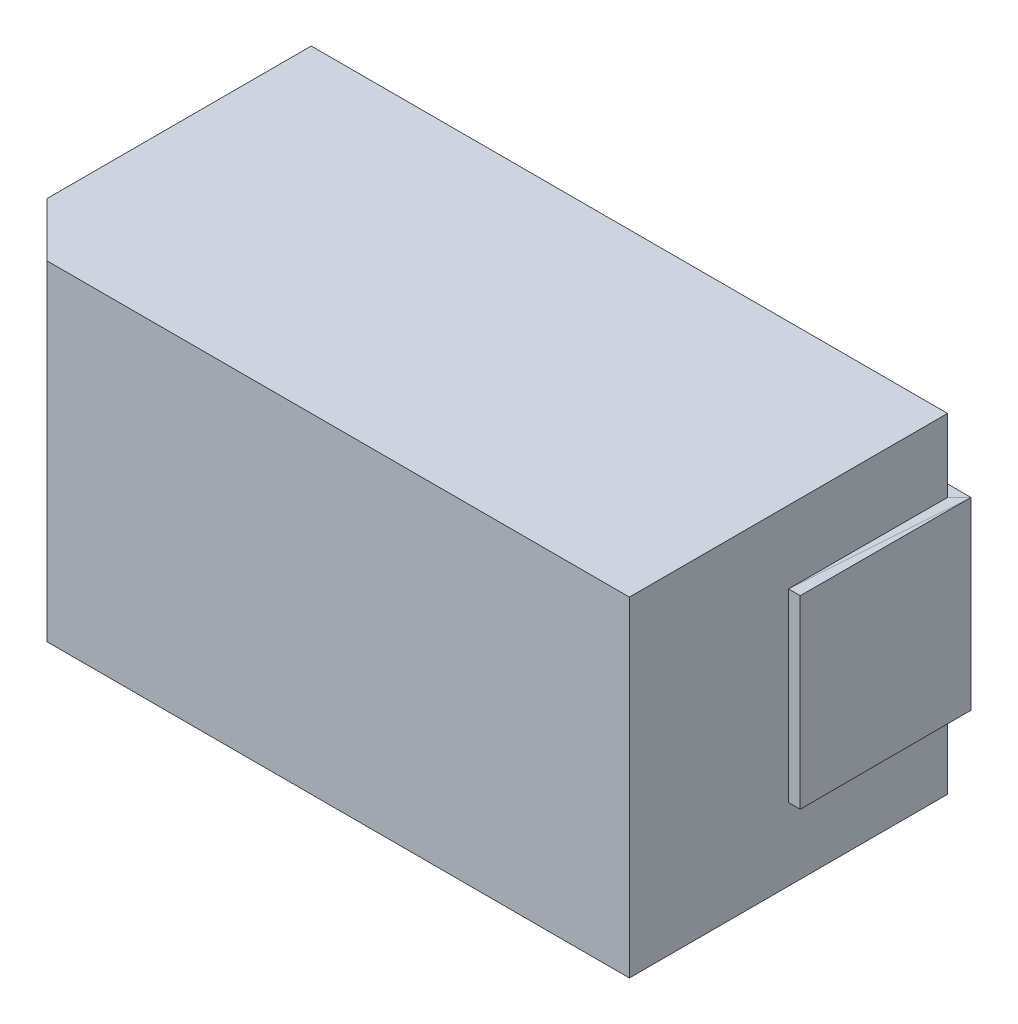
ISO-10303-21;
HEADER;
FILE_DESCRIPTION(('STEP AP214'),'2;1');
FILE_NAME('part.step','',(''),(''),'','','');
FILE_SCHEMA(('AUTOMOTIVE_DESIGN { 1 0 10303 214 1 1 1 1 }'));
ENDSEC;
DATA;
#1=APPLICATION_CONTEXT('core data for automotive mechanical design processes');
#2=APPLICATION_PROTOCOL_DEFINITION('international standard','automotive_design',2000,#1);
#3=PRODUCT_CONTEXT('',#1,'mechanical');
#4=PRODUCT('Part','Part','',(#3));
#5=PRODUCT_RELATED_PRODUCT_CATEGORY('part','',(#4));
#6=PRODUCT_DEFINITION_FORMATION('','',#4);
#7=PRODUCT_DEFINITION_CONTEXT('part definition',#1,'design');
#8=PRODUCT_DEFINITION('design','',#6,#7);
#9=PRODUCT_DEFINITION_SHAPE('','',#8);
#10=(LENGTH_UNIT() NAMED_UNIT(*) SI_UNIT(.MILLI.,.METRE.));
#11=(NAMED_UNIT(*) PLANE_ANGLE_UNIT() SI_UNIT($,.RADIAN.));
#12=(NAMED_UNIT(*) SI_UNIT($,.STERADIAN.) SOLID_ANGLE_UNIT());
#13=UNCERTAINTY_MEASURE_WITH_UNIT(LENGTH_MEASURE(1.E-05),#10,'distance_accuracy_value','');
#14=(GEOMETRIC_REPRESENTATION_CONTEXT(3) GLOBAL_UNCERTAINTY_ASSIGNED_CONTEXT((#13)) GLOBAL_UNIT_ASSIGNED_CONTEXT((#10,
#11,#12)) REPRESENTATION_CONTEXT('',''));
#15=CARTESIAN_POINT('',(0.,0.,0.));
#16=DIRECTION('',(0.,0.,1.));
#17=DIRECTION('',(1.,0.,0.));
#18=AXIS2_PLACEMENT_3D('',#15,#16,#17);
#19=CARTESIAN_POINT('',(-1.530000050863,-0.427379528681,0.0113731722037));
#20=DIRECTION('',(0.,0.,1.));
#21=DIRECTION('',(1.,0.,0.));
#22=AXIS2_PLACEMENT_3D('',#19,#20,#21);
#23=PLANE('',#22);
#24=DIRECTION('',(0.,1.,0.));
#25=VECTOR('',#24,1.);
#26=CARTESIAN_POINT('',(-0.491878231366,-0.427379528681,0.0113731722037));
#27=LINE('',#26,#25);
#28=CARTESIAN_POINT('',(-0.491878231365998,0.427380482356,0.0113731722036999));
#29=VERTEX_POINT('',#28);
#30=CARTESIAN_POINT('',(-0.491878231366,-0.427379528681,0.0113731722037));
#31=VERTEX_POINT('',#30);
#32=EDGE_CURVE('E163',#29,#31,#27,.F.);
#33=ORIENTED_EDGE('',*,*,#32,.T.);
#34=DIRECTION('',(1.,0.,0.));
#35=VECTOR('',#34,1.);
#36=CARTESIAN_POINT('',(-0.491878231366,-0.427379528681,0.0113731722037));
#37=LINE('',#36,#35);
#38=CARTESIAN_POINT('',(-1.530000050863,-0.42737952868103,0.0113731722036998));
#39=VERTEX_POINT('',#38);
#40=EDGE_CURVE('E142',#31,#39,#37,.F.);
#41=ORIENTED_EDGE('',*,*,#40,.T.);
#42=DIRECTION('',(0.,1.,0.));
#43=VECTOR('',#42,1.);
#44=CARTESIAN_POINT('',(-1.530000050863,-0.427379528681,0.0113731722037));
#45=LINE('',#44,#43);
#46=CARTESIAN_POINT('',(-1.530000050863,0.427380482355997,0.0113731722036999));
#47=VERTEX_POINT('',#46);
#48=EDGE_CURVE('E20',#47,#39,#45,.F.);
#49=ORIENTED_EDGE('',*,*,#48,.F.);
#50=DIRECTION('',(1.,0.,0.));
#51=VECTOR('',#50,1.);
#52=CARTESIAN_POINT('',(-1.475634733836,0.427380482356,0.0113731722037));
#53=LINE('',#52,#51);
#54=EDGE_CURVE('E139',#47,#29,#53,.T.);
#55=ORIENTED_EDGE('',*,*,#54,.T.);
#56=EDGE_LOOP('',(#33,#41,#49,#55));
#57=FACE_BOUND('',#56,.T.);
#58=ADVANCED_FACE('F17',(#57),#23,.F.);
#59=CARTESIAN_POINT('',(-1.530000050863,-0.427379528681,0.0113731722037));
#60=DIRECTION('',(1.,0.,0.));
#61=DIRECTION('',(0.,0.,-1.));
#62=AXIS2_PLACEMENT_3D('',#59,#60,#61);
#63=PLANE('',#62);
#64=DIRECTION('',(0.,1.,0.));
#65=VECTOR('',#64,1.);
#66=CARTESIAN_POINT('',(-1.530000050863,-0.428848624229,0.803555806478));
#67=LINE('',#66,#65);
#68=CARTESIAN_POINT('',(-1.530000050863,-0.428848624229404,0.803555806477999));
#69=VERTEX_POINT('',#68);
#70=CARTESIAN_POINT('',(-1.530000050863,0.428842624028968,0.803555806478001));
#71=VERTEX_POINT('',#70);
#72=EDGE_CURVE('E151',#69,#71,#67,.T.);
#73=ORIENTED_EDGE('',*,*,#72,.T.);
#74=DIRECTION('',(0.,-0.00184570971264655,-0.999998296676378));
#75=VECTOR('',#74,1.);
#76=CARTESIAN_POINT('',(-1.530000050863,0.428102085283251,0.402334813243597));
#77=LINE('',#76,#75);
#78=EDGE_CURVE('E148',#71,#47,#77,.T.);
#79=ORIENTED_EDGE('',*,*,#78,.T.);
#80=ORIENTED_EDGE('',*,*,#48,.T.);
#81=DIRECTION('',(0.,0.00185448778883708,-0.999998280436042));
#82=VECTOR('',#81,1.);
#83=CARTESIAN_POINT('',(-1.530000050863,-0.428138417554,0.420589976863));
#84=LINE('',#83,#82);
#85=EDGE_CURVE('E146',#69,#39,#84,.T.);
#86=ORIENTED_EDGE('',*,*,#85,.F.);
#87=EDGE_LOOP('',(#73,#79,#80,#86));
#88=FACE_BOUND('',#87,.T.);
#89=ADVANCED_FACE('F149',(#88),#63,.F.);
#90=CARTESIAN_POINT('',(-1.515942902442,-0.428138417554,0.420589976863));
#91=DIRECTION('',(0.,-0.999998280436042,-0.00185448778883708));
#92=DIRECTION('',(0.,0.00185448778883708,-0.999998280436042));
#93=AXIS2_PLACEMENT_3D('',#90,#91,#92);
#94=PLANE('',#93);
#95=ORIENTED_EDGE('',*,*,#85,.T.);
#96=DIRECTION('',(0.0684660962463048,-0.00185013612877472,0.997651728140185));
#97=VECTOR('',#96,1.);
#98=CARTESIAN_POINT('',(-1.530000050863,-0.427379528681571,0.0113731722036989));
#99=LINE('',#98,#97);
#100=CARTESIAN_POINT('',(-1.475634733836,-0.428848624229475,0.803555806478));
#101=VERTEX_POINT('',#100);
#102=EDGE_CURVE('E175',#39,#101,#99,.T.);
#103=ORIENTED_EDGE('',*,*,#102,.T.);
#104=DIRECTION('',(-1.,0.,0.));
#105=VECTOR('',#104,1.);
#106=CARTESIAN_POINT('',(-1.475634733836,-0.428848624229,0.803555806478));
#107=LINE('',#106,#105);
#108=EDGE_CURVE('E177',#101,#69,#107,.T.);
#109=ORIENTED_EDGE('',*,*,#108,.T.);
#110=EDGE_LOOP('',(#95,#103,#109));
#111=FACE_BOUND('',#110,.T.);
#112=ADVANCED_FACE('F174',(#111),#94,.T.);
#113=CARTESIAN_POINT('',(-1.516201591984,0.428076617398,0.40233486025));
#114=DIRECTION('',(-0.00184570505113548,-0.99999659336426,0.00184570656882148));
#115=DIRECTION('',(0.,-0.00184570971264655,-0.999998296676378));
#116=AXIS2_PLACEMENT_3D('',#113,#114,#115);
#117=PLANE('',#116);
#118=ORIENTED_EDGE('',*,*,#78,.F.);
#119=DIRECTION('',(0.0734846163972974,-0.00197635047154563,-0.997294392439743));
#120=VECTOR('',#119,1.);
#121=CARTESIAN_POINT('',(-1.530000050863,0.428842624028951,0.803555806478));
#122=LINE('',#121,#120);
#123=CARTESIAN_POINT('',(-1.475634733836,0.427380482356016,0.0657384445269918));
#124=VERTEX_POINT('',#123);
#125=EDGE_CURVE('E166',#71,#124,#122,.T.);
#126=ORIENTED_EDGE('',*,*,#125,.T.);
#127=DIRECTION('',(-0.707107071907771,0.,-0.707106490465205));
#128=VECTOR('',#127,1.);
#129=CARTESIAN_POINT('',(-1.475634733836,0.427380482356,0.06573844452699));
#130=LINE('',#129,#128);
#131=EDGE_CURVE('E157',#124,#47,#130,.T.);
#132=ORIENTED_EDGE('',*,*,#131,.T.);
#133=EDGE_LOOP('',(#118,#126,#132));
#134=FACE_BOUND('',#133,.T.);
#135=ADVANCED_FACE('F165',(#134),#117,.F.);
#136=CARTESIAN_POINT('',(1.530000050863,0.427379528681,0.0113731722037));
#137=DIRECTION('',(0.,0.,1.));
#138=DIRECTION('',(1.,0.,0.));
#139=AXIS2_PLACEMENT_3D('',#136,#137,#138);
#140=PLANE('',#139);
#141=DIRECTION('',(1.,0.,0.));
#142=VECTOR('',#141,1.);
#143=CARTESIAN_POINT('',(1.475634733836,-0.427380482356,0.0113731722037));
#144=LINE('',#143,#142);
#145=CARTESIAN_POINT('',(1.530000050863,-0.42738048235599,0.0113731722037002));
#146=VERTEX_POINT('',#145);
#147=CARTESIAN_POINT('',(0.491878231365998,-0.427380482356,0.0113731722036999));
#148=VERTEX_POINT('',#147);
#149=EDGE_CURVE('E271',#146,#148,#144,.F.);
#150=ORIENTED_EDGE('',*,*,#149,.T.);
#151=DIRECTION('',(0.,1.,0.));
#152=VECTOR('',#151,1.);
#153=CARTESIAN_POINT('',(0.491878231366,0.427379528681,0.0113731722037));
#154=LINE('',#153,#152);
#155=CARTESIAN_POINT('',(0.491878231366,0.427379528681,0.0113731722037));
#156=VERTEX_POINT('',#155);
#157=EDGE_CURVE('E198',#148,#156,#154,.T.);
#158=ORIENTED_EDGE('',*,*,#157,.T.);
#159=DIRECTION('',(1.,0.,0.));
#160=VECTOR('',#159,1.);
#161=CARTESIAN_POINT('',(0.491878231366,0.427379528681,0.0113731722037));
#162=LINE('',#161,#160);
#163=CARTESIAN_POINT('',(1.53000005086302,0.427379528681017,0.0113731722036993));
#164=VERTEX_POINT('',#163);
#165=EDGE_CURVE('E131',#156,#164,#162,.T.);
#166=ORIENTED_EDGE('',*,*,#165,.T.);
#167=DIRECTION('',(0.,1.,0.));
#168=VECTOR('',#167,1.);
#169=CARTESIAN_POINT('',(1.530000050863,0.427379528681,0.0113731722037));
#170=LINE('',#169,#168);
#171=EDGE_CURVE('E186',#164,#146,#170,.F.);
#172=ORIENTED_EDGE('',*,*,#171,.T.);
#173=EDGE_LOOP('',(#150,#158,#166,#172));
#174=FACE_BOUND('',#173,.T.);
#175=ADVANCED_FACE('F276',(#174),#140,.F.);
#176=CARTESIAN_POINT('',(-1.490350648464,-0.428078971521,0.402300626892));
#177=DIRECTION('',(-0.0019911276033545,0.999996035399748,0.0019911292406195));
#178=DIRECTION('',(0.,-0.00199113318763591,0.99999801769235));
#179=AXIS2_PLACEMENT_3D('',#176,#177,#178);
#180=PLANE('',#179);
#181=ORIENTED_EDGE('',*,*,#102,.F.);
#182=DIRECTION('',(0.707107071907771,0.,0.707106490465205));
#183=VECTOR('',#182,1.);
#184=CARTESIAN_POINT('',(-1.530000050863,-0.427379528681,0.0113731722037));
#185=LINE('',#184,#183);
#186=CARTESIAN_POINT('',(-1.475634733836,-0.427379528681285,0.0657384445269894));
#187=VERTEX_POINT('',#186);
#188=EDGE_CURVE('E182',#39,#187,#185,.T.);
#189=ORIENTED_EDGE('',*,*,#188,.T.);
#190=DIRECTION('',(0.,-0.00199113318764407,0.99999801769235));
#191=VECTOR('',#190,1.);
#192=CARTESIAN_POINT('',(-1.475634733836,-0.427379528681,0.06573844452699));
#193=LINE('',#192,#191);
#194=EDGE_CURVE('E184',#187,#101,#193,.T.);
#195=ORIENTED_EDGE('',*,*,#194,.T.);
#196=EDGE_LOOP('',(#181,#189,#195));
#197=FACE_BOUND('',#196,.T.);
#198=ADVANCED_FACE('F181',(#197),#180,.F.);
#199=CARTESIAN_POINT('',(-1.489726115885,0.428137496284,0.447738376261));
#200=DIRECTION('',(0.,-0.999998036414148,0.00198170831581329));
#201=DIRECTION('',(0.,-0.00198170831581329,-0.999998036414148));
#202=AXIS2_PLACEMENT_3D('',#199,#200,#201);
#203=PLANE('',#202);
#204=DIRECTION('',(-1.,0.,0.));
#205=VECTOR('',#204,1.);
#206=CARTESIAN_POINT('',(-1.475634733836,0.428842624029,0.803555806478));
#207=LINE('',#206,#205);
#208=CARTESIAN_POINT('',(-1.475634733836,0.428842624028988,0.803555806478));
#209=VERTEX_POINT('',#208);
#210=EDGE_CURVE('E261',#71,#209,#207,.F.);
#211=ORIENTED_EDGE('',*,*,#210,.T.);
#212=DIRECTION('',(0.,-0.00198170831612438,-0.999998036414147));
#213=VECTOR('',#212,1.);
#214=CARTESIAN_POINT('',(-1.475634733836,0.428842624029,0.803555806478));
#215=LINE('',#214,#213);
#216=EDGE_CURVE('E254',#209,#124,#215,.T.);
#217=ORIENTED_EDGE('',*,*,#216,.T.);
#218=ORIENTED_EDGE('',*,*,#125,.F.);
#219=EDGE_LOOP('',(#211,#217,#218));
#220=FACE_BOUND('',#219,.T.);
#221=ADVANCED_FACE('F329',(#220),#203,.F.);
#222=CARTESIAN_POINT('',(-1.475634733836,0.427380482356,0.06573844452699));
#223=DIRECTION('',(0.,-1.,0.));
#224=DIRECTION('',(0.,0.,-1.));
#225=AXIS2_PLACEMENT_3D('',#222,#223,#224);
#226=PLANE('',#225);
#227=DIRECTION('',(0.,0.,1.));
#228=VECTOR('',#227,1.);
#229=CARTESIAN_POINT('',(-0.491878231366,0.427380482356,0.06573844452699));
#230=LINE('',#229,#228);
#231=CARTESIAN_POINT('',(-0.491878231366,0.427380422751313,0.06573844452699));
#232=VERTEX_POINT('',#231);
#233=EDGE_CURVE('E162',#232,#29,#230,.F.);
#234=ORIENTED_EDGE('',*,*,#233,.T.);
#235=ORIENTED_EDGE('',*,*,#54,.F.);
#236=ORIENTED_EDGE('',*,*,#131,.F.);
#237=DIRECTION('',(1.,0.,0.));
#238=VECTOR('',#237,1.);
#239=CARTESIAN_POINT('',(-0.491878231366,0.427380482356,0.06573844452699));
#240=LINE('',#239,#238);
#241=EDGE_CURVE('E213',#124,#232,#240,.T.);
#242=ORIENTED_EDGE('',*,*,#241,.T.);
#243=EDGE_LOOP('',(#234,#235,#236,#242));
#244=FACE_BOUND('',#243,.T.);
#245=ADVANCED_FACE('F160',(#244),#226,.F.);
#246=CARTESIAN_POINT('',(-0.491878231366,0.427380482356,0.06573844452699));
#247=DIRECTION('',(-1.,0.,0.));
#248=DIRECTION('',(0.,0.,1.));
#249=AXIS2_PLACEMENT_3D('',#246,#247,#248);
#250=PLANE('',#249);
#251=DIRECTION('',(0.,1.,0.));
#252=VECTOR('',#251,1.);
#253=CARTESIAN_POINT('',(-0.491878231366,0.427379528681,0.06573844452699));
#254=LINE('',#253,#252);
#255=CARTESIAN_POINT('',(-0.491878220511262,-0.427379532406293,0.0657384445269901));
#256=VERTEX_POINT('',#255);
#257=EDGE_CURVE('E208',#232,#256,#254,.F.);
#258=ORIENTED_EDGE('',*,*,#257,.T.);
#259=DIRECTION('',(0.,0.,1.));
#260=VECTOR('',#259,1.);
#261=CARTESIAN_POINT('',(-0.491878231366,-0.427379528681,0.06573844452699));
#262=LINE('',#261,#260);
#263=EDGE_CURVE('E193',#256,#31,#262,.F.);
#264=ORIENTED_EDGE('',*,*,#263,.T.);
#265=ORIENTED_EDGE('',*,*,#32,.F.);
#266=ORIENTED_EDGE('',*,*,#233,.F.);
#267=EDGE_LOOP('',(#258,#264,#265,#266));
#268=FACE_BOUND('',#267,.T.);
#269=ADVANCED_FACE('F206',(#268),#250,.F.);
#270=CARTESIAN_POINT('',(1.475634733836,0.427379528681,0.06573844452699));
#271=DIRECTION('',(0.,-1.,0.));
#272=DIRECTION('',(0.,0.,-1.));
#273=AXIS2_PLACEMENT_3D('',#270,#271,#272);
#274=PLANE('',#273);
#275=DIRECTION('',(0.707107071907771,0.,-0.707106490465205));
#276=VECTOR('',#275,1.);
#277=CARTESIAN_POINT('',(1.475634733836,0.427379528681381,0.0657384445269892));
#278=LINE('',#277,#276);
#279=CARTESIAN_POINT('',(1.475634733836,0.427379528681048,0.0657384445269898));
#280=VERTEX_POINT('',#279);
#281=EDGE_CURVE('E268',#280,#164,#278,.T.);
#282=ORIENTED_EDGE('',*,*,#281,.T.);
#283=ORIENTED_EDGE('',*,*,#165,.F.);
#284=DIRECTION('',(0.,0.,-1.));
#285=VECTOR('',#284,1.);
#286=CARTESIAN_POINT('',(0.491878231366,0.427379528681,0.06573844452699));
#287=LINE('',#286,#285);
#288=CARTESIAN_POINT('',(0.491878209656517,0.427379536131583,0.0657384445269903));
#289=VERTEX_POINT('',#288);
#290=EDGE_CURVE('E196',#156,#289,#287,.F.);
#291=ORIENTED_EDGE('',*,*,#290,.T.);
#292=DIRECTION('',(1.,0.,0.));
#293=VECTOR('',#292,1.);
#294=CARTESIAN_POINT('',(1.475634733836,0.427379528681,0.06573844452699));
#295=LINE('',#294,#293);
#296=EDGE_CURVE('E212',#289,#280,#295,.T.);
#297=ORIENTED_EDGE('',*,*,#296,.T.);
#298=EDGE_LOOP('',(#282,#283,#291,#297));
#299=FACE_BOUND('',#298,.T.);
#300=ADVANCED_FACE('F392',(#299),#274,.F.);
#301=CARTESIAN_POINT('',(1.490350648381,0.428089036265,0.40230062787));
#302=DIRECTION('',(0.00201977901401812,-0.999995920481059,0.00201978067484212));
#303=DIRECTION('',(0.,-0.00201978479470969,-0.999997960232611));
#304=AXIS2_PLACEMENT_3D('',#301,#302,#303);
#305=PLANE('',#304);
#306=DIRECTION('',(0.0684660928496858,-0.00187675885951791,-0.997651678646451));
#307=VECTOR('',#306,1.);
#308=CARTESIAN_POINT('',(1.475634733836,0.428869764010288,0.803555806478));
#309=LINE('',#308,#307);
#310=CARTESIAN_POINT('',(1.475634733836,0.4288697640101,0.803555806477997));
#311=VERTEX_POINT('',#310);
#312=EDGE_CURVE('E251',#311,#164,#309,.T.);
#313=ORIENTED_EDGE('',*,*,#312,.T.);
#314=ORIENTED_EDGE('',*,*,#281,.F.);
#315=DIRECTION('',(0.,0.0020197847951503,0.99999796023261));
#316=VECTOR('',#315,1.);
#317=CARTESIAN_POINT('',(1.475634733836,0.427379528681,0.06573844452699));
#318=LINE('',#317,#316);
#319=EDGE_CURVE('E230',#280,#311,#318,.T.);
#320=ORIENTED_EDGE('',*,*,#319,.T.);
#321=EDGE_LOOP('',(#313,#314,#320));
#322=FACE_BOUND('',#321,.T.);
#323=ADVANCED_FACE('F389',(#322),#305,.F.);
#324=CARTESIAN_POINT('',(1.475634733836,-0.427380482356,0.06573844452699));
#325=DIRECTION('',(0.,1.,0.));
#326=DIRECTION('',(0.,0.,1.));
#327=AXIS2_PLACEMENT_3D('',#324,#325,#326);
#328=PLANE('',#327);
#329=DIRECTION('',(0.,0.,-1.));
#330=VECTOR('',#329,1.);
#331=CARTESIAN_POINT('',(0.491878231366,-0.427380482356,0.06573844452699));
#332=LINE('',#331,#330);
#333=CARTESIAN_POINT('',(0.491878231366,-0.427380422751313,0.06573844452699));
#334=VERTEX_POINT('',#333);
#335=EDGE_CURVE('E265',#334,#148,#332,.T.);
#336=ORIENTED_EDGE('',*,*,#335,.T.);
#337=ORIENTED_EDGE('',*,*,#149,.F.);
#338=DIRECTION('',(-0.707107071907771,0.,0.707106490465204));
#339=VECTOR('',#338,1.);
#340=CARTESIAN_POINT('',(1.530000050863,-0.427380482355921,0.0113731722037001));
#341=LINE('',#340,#339);
#342=CARTESIAN_POINT('',(1.475634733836,-0.42738048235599,0.0657384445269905));
#343=VERTEX_POINT('',#342);
#344=EDGE_CURVE('E242',#146,#343,#341,.T.);
#345=ORIENTED_EDGE('',*,*,#344,.T.);
#346=DIRECTION('',(1.,0.,0.));
#347=VECTOR('',#346,1.);
#348=CARTESIAN_POINT('',(0.491878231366,-0.427380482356,0.06573844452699));
#349=LINE('',#348,#347);
#350=EDGE_CURVE('E224',#343,#334,#349,.F.);
#351=ORIENTED_EDGE('',*,*,#350,.T.);
#352=EDGE_LOOP('',(#336,#337,#345,#351));
#353=FACE_BOUND('',#352,.T.);
#354=ADVANCED_FACE('F385',(#353),#328,.F.);
#355=CARTESIAN_POINT('',(0.491878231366,0.427379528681,0.06573844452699));
#356=DIRECTION('',(1.,0.,0.));
#357=DIRECTION('',(0.,0.,-1.));
#358=AXIS2_PLACEMENT_3D('',#355,#356,#357);
#359=PLANE('',#358);
#360=ORIENTED_EDGE('',*,*,#335,.F.);
#361=DIRECTION('',(0.,1.,0.));
#362=VECTOR('',#361,1.);
#363=CARTESIAN_POINT('',(0.491878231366,0.427379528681,0.06573844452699));
#364=LINE('',#363,#362);
#365=EDGE_CURVE('E219',#334,#289,#364,.T.);
#366=ORIENTED_EDGE('',*,*,#365,.T.);
#367=ORIENTED_EDGE('',*,*,#290,.F.);
#368=ORIENTED_EDGE('',*,*,#157,.F.);
#369=EDGE_LOOP('',(#360,#366,#367,#368));
#370=FACE_BOUND('',#369,.T.);
#371=ADVANCED_FACE('F382',(#370),#359,.F.);
#372=CARTESIAN_POINT('',(-1.475634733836,-0.427379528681,0.06573844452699));
#373=DIRECTION('',(0.,1.,0.));
#374=DIRECTION('',(0.,0.,1.));
#375=AXIS2_PLACEMENT_3D('',#372,#373,#374);
#376=PLANE('',#375);
#377=ORIENTED_EDGE('',*,*,#188,.F.);
#378=ORIENTED_EDGE('',*,*,#40,.F.);
#379=ORIENTED_EDGE('',*,*,#263,.F.);
#380=DIRECTION('',(1.,0.,0.));
#381=VECTOR('',#380,1.);
#382=CARTESIAN_POINT('',(-1.475634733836,-0.427379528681,0.06573844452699));
#383=LINE('',#382,#381);
#384=EDGE_CURVE('E215',#256,#187,#383,.F.);
#385=ORIENTED_EDGE('',*,*,#384,.T.);
#386=EDGE_LOOP('',(#377,#378,#379,#385));
#387=FACE_BOUND('',#386,.T.);
#388=ADVANCED_FACE('F203',(#387),#376,.F.);
#389=CARTESIAN_POINT('',(-1.475634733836,-0.428848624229,0.803555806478));
#390=DIRECTION('',(0.,0.,-1.));
#391=DIRECTION('',(-1.,0.,0.));
#392=AXIS2_PLACEMENT_3D('',#389,#390,#391);
#393=PLANE('',#392);
#394=ORIENTED_EDGE('',*,*,#210,.F.);
#395=ORIENTED_EDGE('',*,*,#72,.F.);
#396=ORIENTED_EDGE('',*,*,#108,.F.);
#397=DIRECTION('',(0.,1.,0.));
#398=VECTOR('',#397,1.);
#399=CARTESIAN_POINT('',(-1.475634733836,-0.428848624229,0.803555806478));
#400=LINE('',#399,#398);
#401=EDGE_CURVE('E221',#101,#209,#400,.T.);
#402=ORIENTED_EDGE('',*,*,#401,.T.);
#403=EDGE_LOOP('',(#394,#395,#396,#402));
#404=FACE_BOUND('',#403,.T.);
#405=ADVANCED_FACE('F323',(#404),#393,.F.);
#406=CARTESIAN_POINT('',(1.515942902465,0.428149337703,0.420589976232));
#407=DIRECTION('',(0.,-0.999998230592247,0.00188117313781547));
#408=DIRECTION('',(0.,-0.00188117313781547,-0.999998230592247));
#409=AXIS2_PLACEMENT_3D('',#406,#407,#408);
#410=PLANE('',#409);
#411=DIRECTION('',(0.,-0.00188117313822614,-0.999998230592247));
#412=VECTOR('',#411,1.);
#413=CARTESIAN_POINT('',(1.530000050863,0.42886976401,0.803555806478));
#414=LINE('',#413,#412);
#415=CARTESIAN_POINT('',(1.530000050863,0.428869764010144,0.803555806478));
#416=VERTEX_POINT('',#415);
#417=EDGE_CURVE('E248',#416,#164,#414,.T.);
#418=ORIENTED_EDGE('',*,*,#417,.T.);
#419=ORIENTED_EDGE('',*,*,#312,.F.);
#420=DIRECTION('',(-1.,0.,0.));
#421=VECTOR('',#420,1.);
#422=CARTESIAN_POINT('',(1.475634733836,0.42886976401,0.803555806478));
#423=LINE('',#422,#421);
#424=EDGE_CURVE('E294',#311,#416,#423,.F.);
#425=ORIENTED_EDGE('',*,*,#424,.T.);
#426=EDGE_LOOP('',(#418,#419,#425));
#427=FACE_BOUND('',#426,.T.);
#428=ADVANCED_FACE('F374',(#427),#410,.F.);
#429=CARTESIAN_POINT('',(1.530000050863,0.427379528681,0.0113731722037));
#430=DIRECTION('',(-1.,0.,0.));
#431=DIRECTION('',(0.,0.,1.));
#432=AXIS2_PLACEMENT_3D('',#429,#430,#431);
#433=PLANE('',#432);
#434=DIRECTION('',(0.,1.,0.));
#435=VECTOR('',#434,1.);
#436=CARTESIAN_POINT('',(1.530000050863,0.42886976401,0.803555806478));
#437=LINE('',#436,#435);
#438=CARTESIAN_POINT('',(1.530000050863,-0.428863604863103,0.803555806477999));
#439=VERTEX_POINT('',#438);
#440=EDGE_CURVE('E289',#416,#439,#437,.F.);
#441=ORIENTED_EDGE('',*,*,#440,.T.);
#442=DIRECTION('',(0.,-0.00187219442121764,0.999998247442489));
#443=VECTOR('',#442,1.);
#444=CARTESIAN_POINT('',(1.530000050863,-0.428112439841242,0.402334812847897));
#445=LINE('',#444,#443);
#446=EDGE_CURVE('E245',#439,#146,#445,.F.);
#447=ORIENTED_EDGE('',*,*,#446,.T.);
#448=ORIENTED_EDGE('',*,*,#171,.F.);
#449=ORIENTED_EDGE('',*,*,#417,.F.);
#450=EDGE_LOOP('',(#441,#447,#448,#449));
#451=FACE_BOUND('',#450,.T.);
#452=ADVANCED_FACE('F287',(#451),#433,.F.);
#453=CARTESIAN_POINT('',(1.516201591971,-0.42808660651,0.402334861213));
#454=DIRECTION('',(0.00187218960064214,0.999996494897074,0.00187219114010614));
#455=DIRECTION('',(0.,-0.00187219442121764,0.999998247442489));
#456=AXIS2_PLACEMENT_3D('',#453,#454,#455);
#457=PLANE('',#456);
#458=ORIENTED_EDGE('',*,*,#446,.F.);
#459=DIRECTION('',(-0.0734846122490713,0.00200470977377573,-0.997294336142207));
#460=VECTOR('',#459,1.);
#461=CARTESIAN_POINT('',(1.530000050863,-0.42886360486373,0.803555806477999));
#462=LINE('',#461,#460);
#463=EDGE_CURVE('E282',#439,#343,#462,.T.);
#464=ORIENTED_EDGE('',*,*,#463,.T.);
#465=ORIENTED_EDGE('',*,*,#344,.F.);
#466=EDGE_LOOP('',(#458,#464,#465));
#467=FACE_BOUND('',#466,.T.);
#468=ADVANCED_FACE('F280',(#467),#457,.F.);
#469=CARTESIAN_POINT('',(-1.295182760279,-0.07834005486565,1.47171072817));
#470=DIRECTION('',(-0.707106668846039,0.,0.707106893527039));
#471=DIRECTION('',(0.707106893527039,0.,0.707106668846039));
#472=AXIS2_PLACEMENT_3D('',#469,#470,#471);
#473=PLANE('',#472);
#474=DIRECTION('',(0.,1.,0.));
#475=VECTOR('',#474,1.);
#476=CARTESIAN_POINT('',(-1.225520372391,-0.765000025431,1.541373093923));
#477=LINE('',#476,#475);
#478=CARTESIAN_POINT('',(-1.225520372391,-0.765000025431,1.541373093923));
#479=VERTEX_POINT('',#478);
#480=CARTESIAN_POINT('',(-1.22552037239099,0.765000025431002,1.54137309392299));
#481=VERTEX_POINT('',#480);
#482=EDGE_CURVE('E308',#479,#481,#477,.T.);
#483=ORIENTED_EDGE('',*,*,#482,.T.);
#484=DIRECTION('',(0.707106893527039,0.,0.707106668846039));
#485=VECTOR('',#484,1.);
#486=CARTESIAN_POINT('',(-1.405972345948,0.765000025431,1.360921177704));
#487=LINE('',#486,#485);
#488=CARTESIAN_POINT('',(-1.475634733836,0.765000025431,1.291258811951));
#489=VERTEX_POINT('',#488);
#490=EDGE_CURVE('E258',#481,#489,#487,.F.);
#491=ORIENTED_EDGE('',*,*,#490,.T.);
#492=DIRECTION('',(0.,1.,0.));
#493=VECTOR('',#492,1.);
#494=CARTESIAN_POINT('',(-1.475634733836,0.07834005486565,1.291258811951));
#495=LINE('',#494,#493);
#496=CARTESIAN_POINT('',(-1.475634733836,-0.765000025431,1.291258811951));
#497=VERTEX_POINT('',#496);
#498=EDGE_CURVE('E256',#489,#497,#495,.F.);
#499=ORIENTED_EDGE('',*,*,#498,.T.);
#500=DIRECTION('',(0.707106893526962,0.,0.707106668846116));
#501=VECTOR('',#500,1.);
#502=CARTESIAN_POINT('',(-1.475634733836,-0.765000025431,1.291258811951));
#503=LINE('',#502,#501);
#504=EDGE_CURVE('E314',#497,#479,#503,.T.);
#505=ORIENTED_EDGE('',*,*,#504,.T.);
#506=EDGE_LOOP('',(#483,#491,#499,#505));
#507=FACE_BOUND('',#506,.T.);
#508=ADVANCED_FACE('F366',(#507),#473,.T.);
#509=CARTESIAN_POINT('',(1.475634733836,-0.427380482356,0.06573844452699));
#510=DIRECTION('',(0.,0.999997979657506,0.00201014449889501));
#511=DIRECTION('',(0.,-0.00201014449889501,0.999997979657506));
#512=AXIS2_PLACEMENT_3D('',#509,#510,#511);
#513=PLANE('',#512);
#514=DIRECTION('',(-1.,0.,0.));
#515=VECTOR('',#514,1.);
#516=CARTESIAN_POINT('',(1.475634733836,-0.428863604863,0.803555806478));
#517=LINE('',#516,#515);
#518=CARTESIAN_POINT('',(1.475634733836,-0.428863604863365,0.803555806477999));
#519=VERTEX_POINT('',#518);
#520=EDGE_CURVE('E298',#439,#519,#517,.T.);
#521=ORIENTED_EDGE('',*,*,#520,.T.);
#522=DIRECTION('',(0.,0.002010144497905,-0.999997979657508));
#523=VECTOR('',#522,1.);
#524=CARTESIAN_POINT('',(1.475634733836,-0.428863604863,0.803555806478));
#525=LINE('',#524,#523);
#526=EDGE_CURVE('E303',#519,#343,#525,.T.);
#527=ORIENTED_EDGE('',*,*,#526,.T.);
#528=ORIENTED_EDGE('',*,*,#463,.F.);
#529=EDGE_LOOP('',(#521,#527,#528));
#530=FACE_BOUND('',#529,.T.);
#531=ADVANCED_FACE('F363',(#530),#513,.F.);
#532=CARTESIAN_POINT('',(-1.475634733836,-0.765000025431,0.803555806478));
#533=DIRECTION('',(1.,0.,0.));
#534=DIRECTION('',(0.,0.,-1.));
#535=AXIS2_PLACEMENT_3D('',#532,#533,#534);
#536=PLANE('',#535);
#537=DIRECTION('',(0.,0.,1.));
#538=VECTOR('',#537,1.);
#539=CARTESIAN_POINT('',(-1.475634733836,-0.765000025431,0.803555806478));
#540=LINE('',#539,#538);
#541=CARTESIAN_POINT('',(-1.475634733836,-0.765000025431,0.06573844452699));
#542=VERTEX_POINT('',#541);
#543=EDGE_CURVE('E306',#542,#497,#540,.T.);
#544=ORIENTED_EDGE('',*,*,#543,.T.);
#545=ORIENTED_EDGE('',*,*,#498,.F.);
#546=DIRECTION('',(0.,0.,-1.));
#547=VECTOR('',#546,1.);
#548=CARTESIAN_POINT('',(-1.475634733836,0.765000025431,0.803555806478));
#549=LINE('',#548,#547);
#550=CARTESIAN_POINT('',(-1.475634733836,0.765000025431,0.06573844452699));
#551=VERTEX_POINT('',#550);
#552=EDGE_CURVE('E304',#489,#551,#549,.T.);
#553=ORIENTED_EDGE('',*,*,#552,.T.);
#554=DIRECTION('',(0.,1.,0.));
#555=VECTOR('',#554,1.);
#556=CARTESIAN_POINT('',(-1.475634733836,0.765000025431,0.06573844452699));
#557=LINE('',#556,#555);
#558=EDGE_CURVE('E239',#124,#551,#557,.T.);
#559=ORIENTED_EDGE('',*,*,#558,.F.);
#560=ORIENTED_EDGE('',*,*,#216,.F.);
#561=ORIENTED_EDGE('',*,*,#401,.F.);
#562=ORIENTED_EDGE('',*,*,#194,.F.);
#563=DIRECTION('',(0.,1.,0.));
#564=VECTOR('',#563,1.);
#565=CARTESIAN_POINT('',(-1.475634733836,-0.765000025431,0.06573844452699));
#566=LINE('',#565,#564);
#567=EDGE_CURVE('E218',#187,#542,#566,.F.);
#568=ORIENTED_EDGE('',*,*,#567,.T.);
#569=EDGE_LOOP('',(#544,#545,#553,#559,#560,#561,#562,#568));
#570=FACE_BOUND('',#569,.T.);
#571=ADVANCED_FACE('F326',(#570),#536,.F.);
#572=CARTESIAN_POINT('',(1.475634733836,-0.428863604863,0.803555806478));
#573=DIRECTION('',(0.,0.,-1.));
#574=DIRECTION('',(-1.,0.,0.));
#575=AXIS2_PLACEMENT_3D('',#572,#573,#574);
#576=PLANE('',#575);
#577=ORIENTED_EDGE('',*,*,#520,.F.);
#578=ORIENTED_EDGE('',*,*,#440,.F.);
#579=ORIENTED_EDGE('',*,*,#424,.F.);
#580=DIRECTION('',(0.,1.,0.));
#581=VECTOR('',#580,1.);
#582=CARTESIAN_POINT('',(1.475634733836,0.765000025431,0.803555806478));
#583=LINE('',#582,#581);
#584=EDGE_CURVE('E301',#311,#519,#583,.F.);
#585=ORIENTED_EDGE('',*,*,#584,.T.);
#586=EDGE_LOOP('',(#577,#578,#579,#585));
#587=FACE_BOUND('',#586,.T.);
#588=ADVANCED_FACE('F299',(#587),#576,.F.);
#589=CARTESIAN_POINT('',(0.491878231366,-0.765000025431,0.06573844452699));
#590=DIRECTION('',(0.,0.,1.));
#591=DIRECTION('',(1.,0.,0.));
#592=AXIS2_PLACEMENT_3D('',#589,#590,#591);
#593=PLANE('',#592);
#594=DIRECTION('',(1.,0.,0.));
#595=VECTOR('',#594,1.);
#596=CARTESIAN_POINT('',(0.491878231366,-0.765000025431,0.06573844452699));
#597=LINE('',#596,#595);
#598=CARTESIAN_POINT('',(1.475634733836,-0.765000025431,0.06573844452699));
#599=VERTEX_POINT('',#598);
#600=EDGE_CURVE('E638',#599,#542,#597,.F.);
#601=ORIENTED_EDGE('',*,*,#600,.T.);
#602=ORIENTED_EDGE('',*,*,#567,.F.);
#603=ORIENTED_EDGE('',*,*,#384,.F.);
#604=ORIENTED_EDGE('',*,*,#257,.F.);
#605=ORIENTED_EDGE('',*,*,#241,.F.);
#606=ORIENTED_EDGE('',*,*,#558,.T.);
#607=DIRECTION('',(1.,0.,0.));
#608=VECTOR('',#607,1.);
#609=CARTESIAN_POINT('',(0.491878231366,0.765000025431,0.06573844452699));
#610=LINE('',#609,#608);
#611=CARTESIAN_POINT('',(1.475634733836,0.765000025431,0.06573844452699));
#612=VERTEX_POINT('',#611);
#613=EDGE_CURVE('E630',#551,#612,#610,.T.);
#614=ORIENTED_EDGE('',*,*,#613,.T.);
#615=DIRECTION('',(0.,1.,0.));
#616=VECTOR('',#615,1.);
#617=CARTESIAN_POINT('',(1.475634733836,0.765000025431,0.06573844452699));
#618=LINE('',#617,#616);
#619=EDGE_CURVE('E233',#612,#280,#618,.F.);
#620=ORIENTED_EDGE('',*,*,#619,.T.);
#621=ORIENTED_EDGE('',*,*,#296,.F.);
#622=ORIENTED_EDGE('',*,*,#365,.F.);
#623=ORIENTED_EDGE('',*,*,#350,.F.);
#624=DIRECTION('',(0.,1.,0.));
#625=VECTOR('',#624,1.);
#626=CARTESIAN_POINT('',(1.475634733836,-0.765000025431,0.06573844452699));
#627=LINE('',#626,#625);
#628=EDGE_CURVE('E317',#343,#599,#627,.F.);
#629=ORIENTED_EDGE('',*,*,#628,.T.);
#630=EDGE_LOOP('',(#601,#602,#603,#604,#605,#606,#614,#620,#621,#622,#623,#629));
#631=FACE_BOUND('',#630,.T.);
#632=ADVANCED_FACE('F216',(#631),#593,.F.);
#633=CARTESIAN_POINT('',(1.475634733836,0.765000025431,1.541373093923));
#634=DIRECTION('',(-1.,0.,0.));
#635=DIRECTION('',(0.,0.,1.));
#636=AXIS2_PLACEMENT_3D('',#633,#634,#635);
#637=PLANE('',#636);
#638=DIRECTION('',(0.,1.,0.));
#639=VECTOR('',#638,1.);
#640=CARTESIAN_POINT('',(1.475634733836,0.765000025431,1.541373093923));
#641=LINE('',#640,#639);
#642=CARTESIAN_POINT('',(1.475634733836,0.765000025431,1.541373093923));
#643=VERTEX_POINT('',#642);
#644=CARTESIAN_POINT('',(1.475634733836,-0.765000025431,1.541373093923));
#645=VERTEX_POINT('',#644);
#646=EDGE_CURVE('E640',#643,#645,#641,.F.);
#647=ORIENTED_EDGE('',*,*,#646,.T.);
#648=DIRECTION('',(0.,0.,1.));
#649=VECTOR('',#648,1.);
#650=CARTESIAN_POINT('',(1.475634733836,-0.765000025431,1.541373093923));
#651=LINE('',#650,#649);
#652=EDGE_CURVE('E34',#645,#599,#651,.F.);
#653=ORIENTED_EDGE('',*,*,#652,.T.);
#654=ORIENTED_EDGE('',*,*,#628,.F.);
#655=ORIENTED_EDGE('',*,*,#526,.F.);
#656=ORIENTED_EDGE('',*,*,#584,.F.);
#657=ORIENTED_EDGE('',*,*,#319,.F.);
#658=ORIENTED_EDGE('',*,*,#619,.F.);
#659=DIRECTION('',(0.,0.,-1.));
#660=VECTOR('',#659,1.);
#661=CARTESIAN_POINT('',(1.475634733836,0.765000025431,1.541373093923));
#662=LINE('',#661,#660);
#663=EDGE_CURVE('E633',#612,#643,#662,.F.);
#664=ORIENTED_EDGE('',*,*,#663,.T.);
#665=EDGE_LOOP('',(#647,#653,#654,#655,#656,#657,#658,#664));
#666=FACE_BOUND('',#665,.T.);
#667=ADVANCED_FACE('F352',(#666),#637,.F.);
#668=CARTESIAN_POINT('',(1.475634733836,0.765000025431,1.541373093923));
#669=DIRECTION('',(0.,-1.,0.));
#670=DIRECTION('',(0.,0.,-1.));
#671=AXIS2_PLACEMENT_3D('',#668,#669,#670);
#672=PLANE('',#671);
#673=ORIENTED_EDGE('',*,*,#663,.F.);
#674=ORIENTED_EDGE('',*,*,#613,.F.);
#675=ORIENTED_EDGE('',*,*,#552,.F.);
#676=ORIENTED_EDGE('',*,*,#490,.F.);
#677=DIRECTION('',(-1.,0.,0.));
#678=VECTOR('',#677,1.);
#679=CARTESIAN_POINT('',(1.475634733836,0.765000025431,1.541373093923));
#680=LINE('',#679,#678);
#681=EDGE_CURVE('E26',#481,#643,#680,.F.);
#682=ORIENTED_EDGE('',*,*,#681,.T.);
#683=EDGE_LOOP('',(#673,#674,#675,#676,#682));
#684=FACE_BOUND('',#683,.T.);
#685=ADVANCED_FACE('F347',(#684),#672,.F.);
#686=CARTESIAN_POINT('',(1.475634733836,-0.765000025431,1.541373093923));
#687=DIRECTION('',(0.,1.,0.));
#688=DIRECTION('',(0.,0.,1.));
#689=AXIS2_PLACEMENT_3D('',#686,#687,#688);
#690=PLANE('',#689);
#691=DIRECTION('',(-1.,0.,0.));
#692=VECTOR('',#691,1.);
#693=CARTESIAN_POINT('',(1.475634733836,-0.765000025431,1.541373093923));
#694=LINE('',#693,#692);
#695=EDGE_CURVE('E11',#645,#479,#694,.T.);
#696=ORIENTED_EDGE('',*,*,#695,.T.);
#697=ORIENTED_EDGE('',*,*,#504,.F.);
#698=ORIENTED_EDGE('',*,*,#543,.F.);
#699=ORIENTED_EDGE('',*,*,#600,.F.);
#700=ORIENTED_EDGE('',*,*,#652,.F.);
#701=EDGE_LOOP('',(#696,#697,#698,#699,#700));
#702=FACE_BOUND('',#701,.T.);
#703=ADVANCED_FACE('F341',(#702),#690,.F.);
#704=CARTESIAN_POINT('',(1.475634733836,-0.765000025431,1.541373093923));
#705=DIRECTION('',(0.,0.,-1.));
#706=DIRECTION('',(-1.,0.,0.));
#707=AXIS2_PLACEMENT_3D('',#704,#705,#706);
#708=PLANE('',#707);
#709=ORIENTED_EDGE('',*,*,#681,.F.);
#710=ORIENTED_EDGE('',*,*,#482,.F.);
#711=ORIENTED_EDGE('',*,*,#695,.F.);
#712=ORIENTED_EDGE('',*,*,#646,.F.);
#713=EDGE_LOOP('',(#709,#710,#711,#712));
#714=FACE_BOUND('',#713,.T.);
#715=ADVANCED_FACE('F339',(#714),#708,.F.);
#716=CLOSED_SHELL('',(#58,#89,#112,#135,#175,#198,#221,#245,#269,#300,#323,#354,#371,#388,#405,
#428,#452,#468,#508,#531,#571,#588,#632,#667,#685,#703,#715));
#717=MANIFOLD_SOLID_BREP('B1',#716);
#718=ADVANCED_BREP_SHAPE_REPRESENTATION('',(#18,#717),#14);
#719=SHAPE_DEFINITION_REPRESENTATION(#9,#718);
ENDSEC;
END-ISO-10303-21;
